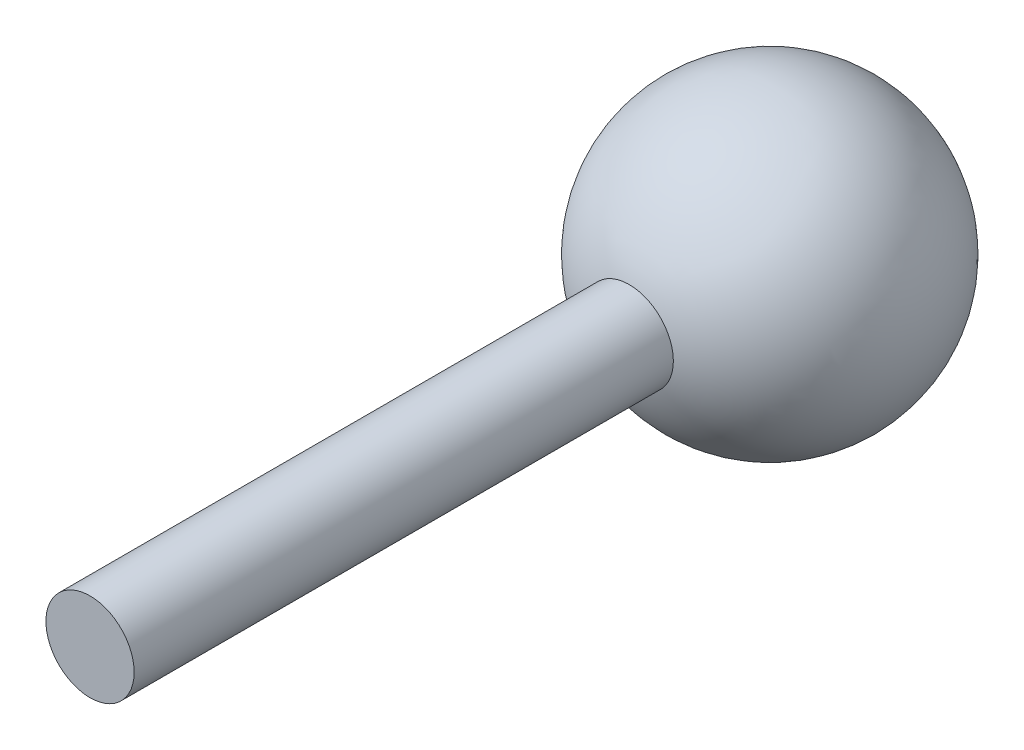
from build123d import *


with BuildPart() as part:
    # Skizze1 → Rotation1 (revolve)
    with BuildSketch(Plane(origin=(0, 0, 0), x_dir=(1, 0, 0), z_dir=(0, 1, 0))):
        with BuildLine():
            Line((0, 0), (0, -65.476782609))
            Line((0, -65.476782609), (3.493390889, -65.476782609))
            Line((3.493390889, -65.476782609), (3.493390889, -22.785805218))
            ThreePointArc((3.493390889, -22.785805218), (11.526021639, -9.893591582), (0, 0))
        make_face()
    revolve(axis=Axis((0, 0, 0), (0, 0, -1)))


solid = part.part
